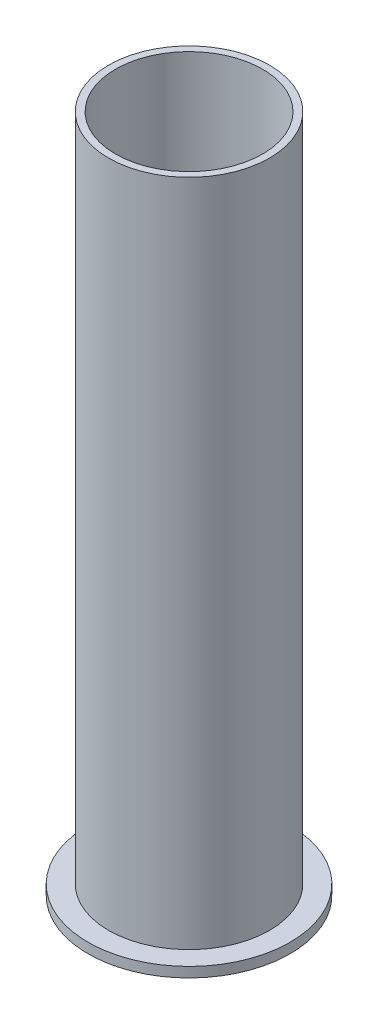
ISO-10303-21;
HEADER;
FILE_DESCRIPTION(('STEP AP214'),'2;1');
FILE_NAME('part.step','',(''),(''),'','','');
FILE_SCHEMA(('AUTOMOTIVE_DESIGN { 1 0 10303 214 1 1 1 1 }'));
ENDSEC;
DATA;
#1=APPLICATION_CONTEXT('core data for automotive mechanical design processes');
#2=APPLICATION_PROTOCOL_DEFINITION('international standard','automotive_design',2000,#1);
#3=PRODUCT_CONTEXT('',#1,'mechanical');
#4=PRODUCT('Part','Part','',(#3));
#5=PRODUCT_RELATED_PRODUCT_CATEGORY('part','',(#4));
#6=PRODUCT_DEFINITION_FORMATION('','',#4);
#7=PRODUCT_DEFINITION_CONTEXT('part definition',#1,'design');
#8=PRODUCT_DEFINITION('design','',#6,#7);
#9=PRODUCT_DEFINITION_SHAPE('','',#8);
#10=(LENGTH_UNIT() NAMED_UNIT(*) SI_UNIT(.MILLI.,.METRE.));
#11=(NAMED_UNIT(*) PLANE_ANGLE_UNIT() SI_UNIT($,.RADIAN.));
#12=(NAMED_UNIT(*) SI_UNIT($,.STERADIAN.) SOLID_ANGLE_UNIT());
#13=UNCERTAINTY_MEASURE_WITH_UNIT(LENGTH_MEASURE(1.E-05),#10,'distance_accuracy_value','');
#14=(GEOMETRIC_REPRESENTATION_CONTEXT(3) GLOBAL_UNCERTAINTY_ASSIGNED_CONTEXT((#13)) GLOBAL_UNIT_ASSIGNED_CONTEXT((#10,
#11,#12)) REPRESENTATION_CONTEXT('',''));
#15=CARTESIAN_POINT('',(0.,0.,0.));
#16=DIRECTION('',(0.,0.,1.));
#17=DIRECTION('',(1.,0.,0.));
#18=AXIS2_PLACEMENT_3D('',#15,#16,#17);
#19=CARTESIAN_POINT('',(0.,53.34,0.));
#20=DIRECTION('',(0.,-1.,0.));
#21=DIRECTION('',(0.,0.,-1.));
#22=AXIS2_PLACEMENT_3D('',#19,#20,#21);
#23=CYLINDRICAL_SURFACE('',#22,6.3246);
#24=CARTESIAN_POINT('',(0.,53.34,0.));
#25=DIRECTION('',(0.,1.,0.));
#26=DIRECTION('',(0.,0.,1.));
#27=AXIS2_PLACEMENT_3D('',#24,#25,#26);
#28=CIRCLE('',#27,6.3246);
#29=CARTESIAN_POINT('',(0.,53.34,6.3246));
#30=VERTEX_POINT('',#29);
#31=EDGE_CURVE('E36',#30,#30,#28,.T.);
#32=ORIENTED_EDGE('',*,*,#31,.F.);
#33=EDGE_LOOP('',(#32));
#34=FACE_BOUND('',#33,.T.);
#35=CARTESIAN_POINT('',(0.,0.787400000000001,0.));
#36=DIRECTION('',(0.,-1.,0.));
#37=DIRECTION('',(0.,0.,-1.));
#38=AXIS2_PLACEMENT_3D('',#35,#36,#37);
#39=CIRCLE('',#38,6.3246);
#40=CARTESIAN_POINT('',(0.,0.787400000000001,-6.3246));
#41=VERTEX_POINT('',#40);
#42=EDGE_CURVE('E10',#41,#41,#39,.T.);
#43=ORIENTED_EDGE('',*,*,#42,.F.);
#44=EDGE_LOOP('',(#43));
#45=FACE_BOUND('',#44,.T.);
#46=ADVANCED_FACE('F33',(#34,#45),#23,.T.);
#47=CARTESIAN_POINT('',(0.,53.34,0.));
#48=DIRECTION('',(0.,1.,0.));
#49=DIRECTION('',(0.,0.,1.));
#50=AXIS2_PLACEMENT_3D('',#47,#48,#49);
#51=PLANE('',#50);
#52=ORIENTED_EDGE('',*,*,#31,.T.);
#53=EDGE_LOOP('',(#52));
#54=FACE_BOUND('',#53,.T.);
#55=CARTESIAN_POINT('',(0.,53.34,0.));
#56=DIRECTION('',(0.,1.,0.));
#57=DIRECTION('',(0.,0.,1.));
#58=AXIS2_PLACEMENT_3D('',#55,#56,#57);
#59=CIRCLE('',#58,5.7785);
#60=CARTESIAN_POINT('',(0.,53.34,5.7785));
#61=VERTEX_POINT('',#60);
#62=EDGE_CURVE('E44',#61,#61,#59,.T.);
#63=ORIENTED_EDGE('',*,*,#62,.F.);
#64=EDGE_LOOP('',(#63));
#65=FACE_BOUND('',#64,.T.);
#66=ADVANCED_FACE('F75',(#54,#65),#51,.T.);
#67=CARTESIAN_POINT('',(0.,0.,0.));
#68=DIRECTION('',(0.,1.,0.));
#69=DIRECTION('',(0.,0.,1.));
#70=AXIS2_PLACEMENT_3D('',#67,#68,#69);
#71=PLANE('',#70);
#72=CARTESIAN_POINT('',(0.,0.,0.));
#73=DIRECTION('',(0.,1.,0.));
#74=DIRECTION('',(0.,0.,1.));
#75=AXIS2_PLACEMENT_3D('',#72,#73,#74);
#76=CIRCLE('',#75,5.7785);
#77=CARTESIAN_POINT('',(0.,0.,5.7785));
#78=VERTEX_POINT('',#77);
#79=EDGE_CURVE('E50',#78,#78,#76,.T.);
#80=ORIENTED_EDGE('',*,*,#79,.T.);
#81=EDGE_LOOP('',(#80));
#82=FACE_BOUND('',#81,.T.);
#83=CARTESIAN_POINT('',(0.,0.,0.));
#84=DIRECTION('',(0.,-1.,0.));
#85=DIRECTION('',(0.,0.,-1.));
#86=AXIS2_PLACEMENT_3D('',#83,#84,#85);
#87=CIRCLE('',#86,7.9375);
#88=CARTESIAN_POINT('',(0.,0.,-7.9375));
#89=VERTEX_POINT('',#88);
#90=EDGE_CURVE('E47',#89,#89,#87,.T.);
#91=ORIENTED_EDGE('',*,*,#90,.T.);
#92=EDGE_LOOP('',(#91));
#93=FACE_BOUND('',#92,.T.);
#94=ADVANCED_FACE('F61',(#82,#93),#71,.F.);
#95=CARTESIAN_POINT('',(0.,53.34,0.));
#96=DIRECTION('',(0.,-1.,0.));
#97=DIRECTION('',(0.,0.,-1.));
#98=AXIS2_PLACEMENT_3D('',#95,#96,#97);
#99=CYLINDRICAL_SURFACE('',#98,5.7785);
#100=ORIENTED_EDGE('',*,*,#79,.F.);
#101=EDGE_LOOP('',(#100));
#102=FACE_BOUND('',#101,.T.);
#103=ORIENTED_EDGE('',*,*,#62,.T.);
#104=EDGE_LOOP('',(#103));
#105=FACE_BOUND('',#104,.T.);
#106=ADVANCED_FACE('F70',(#102,#105),#99,.F.);
#107=CARTESIAN_POINT('',(0.,0.7874,0.));
#108=DIRECTION('',(0.,-1.,0.));
#109=DIRECTION('',(0.,0.,-1.));
#110=AXIS2_PLACEMENT_3D('',#107,#108,#109);
#111=PLANE('',#110);
#112=CARTESIAN_POINT('',(0.,0.7874,0.));
#113=DIRECTION('',(0.,-1.,0.));
#114=DIRECTION('',(0.,0.,-1.));
#115=AXIS2_PLACEMENT_3D('',#112,#113,#114);
#116=CIRCLE('',#115,7.9375);
#117=CARTESIAN_POINT('',(0.,0.7874,-7.9375));
#118=VERTEX_POINT('',#117);
#119=EDGE_CURVE('E52',#118,#118,#116,.T.);
#120=ORIENTED_EDGE('',*,*,#119,.F.);
#121=EDGE_LOOP('',(#120));
#122=FACE_BOUND('',#121,.T.);
#123=ORIENTED_EDGE('',*,*,#42,.T.);
#124=EDGE_LOOP('',(#123));
#125=FACE_BOUND('',#124,.T.);
#126=ADVANCED_FACE('F65',(#122,#125),#111,.F.);
#127=CARTESIAN_POINT('',(0.,0.7874,0.));
#128=DIRECTION('',(0.,-1.,0.));
#129=DIRECTION('',(0.,0.,-1.));
#130=AXIS2_PLACEMENT_3D('',#127,#128,#129);
#131=CYLINDRICAL_SURFACE('',#130,7.9375);
#132=ORIENTED_EDGE('',*,*,#119,.T.);
#133=EDGE_LOOP('',(#132));
#134=FACE_BOUND('',#133,.T.);
#135=ORIENTED_EDGE('',*,*,#90,.F.);
#136=EDGE_LOOP('',(#135));
#137=FACE_BOUND('',#136,.T.);
#138=ADVANCED_FACE('F63',(#134,#137),#131,.T.);
#139=CLOSED_SHELL('',(#46,#66,#94,#106,#126,#138));
#140=MANIFOLD_SOLID_BREP('B2',#139);
#141=ADVANCED_BREP_SHAPE_REPRESENTATION('',(#18,#140),#14);
#142=SHAPE_DEFINITION_REPRESENTATION(#9,#141);
ENDSEC;
END-ISO-10303-21;
